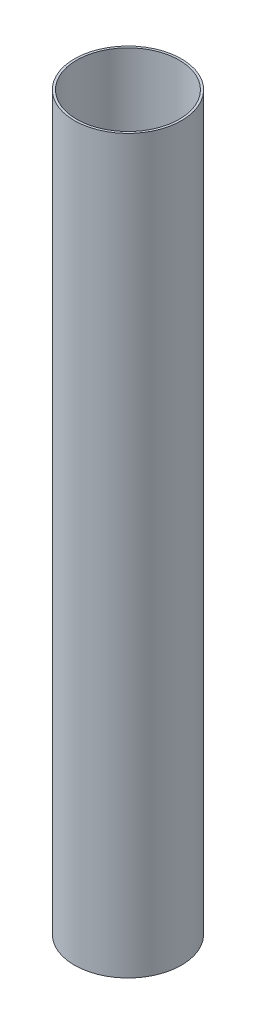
ISO-10303-21;
HEADER;
FILE_DESCRIPTION(('STEP AP214'),'2;1');
FILE_NAME('part.step','',(''),(''),'','','');
FILE_SCHEMA(('AUTOMOTIVE_DESIGN { 1 0 10303 214 1 1 1 1 }'));
ENDSEC;
DATA;
#1=APPLICATION_CONTEXT('core data for automotive mechanical design processes');
#2=APPLICATION_PROTOCOL_DEFINITION('international standard','automotive_design',2000,#1);
#3=PRODUCT_CONTEXT('',#1,'mechanical');
#4=PRODUCT('Part','Part','',(#3));
#5=PRODUCT_RELATED_PRODUCT_CATEGORY('part','',(#4));
#6=PRODUCT_DEFINITION_FORMATION('','',#4);
#7=PRODUCT_DEFINITION_CONTEXT('part definition',#1,'design');
#8=PRODUCT_DEFINITION('design','',#6,#7);
#9=PRODUCT_DEFINITION_SHAPE('','',#8);
#10=(LENGTH_UNIT() NAMED_UNIT(*) SI_UNIT(.MILLI.,.METRE.));
#11=(NAMED_UNIT(*) PLANE_ANGLE_UNIT() SI_UNIT($,.RADIAN.));
#12=(NAMED_UNIT(*) SI_UNIT($,.STERADIAN.) SOLID_ANGLE_UNIT());
#13=UNCERTAINTY_MEASURE_WITH_UNIT(LENGTH_MEASURE(1.E-05),#10,'distance_accuracy_value','');
#14=(GEOMETRIC_REPRESENTATION_CONTEXT(3) GLOBAL_UNCERTAINTY_ASSIGNED_CONTEXT((#13)) GLOBAL_UNIT_ASSIGNED_CONTEXT((#10,
#11,#12)) REPRESENTATION_CONTEXT('',''));
#15=CARTESIAN_POINT('',(0.,0.,0.));
#16=DIRECTION('',(0.,0.,1.));
#17=DIRECTION('',(1.,0.,0.));
#18=AXIS2_PLACEMENT_3D('',#15,#16,#17);
#19=CARTESIAN_POINT('',(0.,1041.4,0.));
#20=DIRECTION('',(0.,1.,0.));
#21=DIRECTION('',(0.,0.,1.));
#22=AXIS2_PLACEMENT_3D('',#19,#20,#21);
#23=PLANE('',#22);
#24=CARTESIAN_POINT('',(0.,1041.4,0.));
#25=DIRECTION('',(0.,1.,0.));
#26=DIRECTION('',(0.,0.,1.));
#27=AXIS2_PLACEMENT_3D('',#24,#25,#26);
#28=CIRCLE('',#27,76.2);
#29=CARTESIAN_POINT('',(0.,1041.4,76.2));
#30=VERTEX_POINT('',#29);
#31=EDGE_CURVE('E10',#30,#30,#28,.T.);
#32=ORIENTED_EDGE('',*,*,#31,.T.);
#33=EDGE_LOOP('',(#32));
#34=FACE_BOUND('',#33,.T.);
#35=CARTESIAN_POINT('',(0.,1041.4,0.));
#36=DIRECTION('',(0.,1.,0.));
#37=DIRECTION('',(0.,0.,1.));
#38=AXIS2_PLACEMENT_3D('',#35,#36,#37);
#39=CIRCLE('',#38,73.025);
#40=CARTESIAN_POINT('',(0.,1041.4,73.025));
#41=VERTEX_POINT('',#40);
#42=EDGE_CURVE('E57',#41,#41,#39,.T.);
#43=ORIENTED_EDGE('',*,*,#42,.F.);
#44=EDGE_LOOP('',(#43));
#45=FACE_BOUND('',#44,.T.);
#46=ADVANCED_FACE('F43',(#34,#45),#23,.T.);
#47=CARTESIAN_POINT('',(0.,0.,0.));
#48=DIRECTION('',(0.,1.,0.));
#49=DIRECTION('',(0.,0.,1.));
#50=AXIS2_PLACEMENT_3D('',#47,#48,#49);
#51=PLANE('',#50);
#52=CARTESIAN_POINT('',(0.,0.,0.));
#53=DIRECTION('',(0.,1.,0.));
#54=DIRECTION('',(0.,0.,1.));
#55=AXIS2_PLACEMENT_3D('',#52,#53,#54);
#56=CIRCLE('',#55,76.2);
#57=CARTESIAN_POINT('',(0.,0.,76.2));
#58=VERTEX_POINT('',#57);
#59=EDGE_CURVE('E50',#58,#58,#56,.T.);
#60=ORIENTED_EDGE('',*,*,#59,.F.);
#61=EDGE_LOOP('',(#60));
#62=FACE_BOUND('',#61,.T.);
#63=CARTESIAN_POINT('',(0.,0.,0.));
#64=DIRECTION('',(0.,1.,0.));
#65=DIRECTION('',(0.,0.,1.));
#66=AXIS2_PLACEMENT_3D('',#63,#64,#65);
#67=CIRCLE('',#66,73.025);
#68=CARTESIAN_POINT('',(0.,0.,73.025));
#69=VERTEX_POINT('',#68);
#70=EDGE_CURVE('E59',#69,#69,#67,.T.);
#71=ORIENTED_EDGE('',*,*,#70,.T.);
#72=EDGE_LOOP('',(#71));
#73=FACE_BOUND('',#72,.T.);
#74=ADVANCED_FACE('F66',(#62,#73),#51,.F.);
#75=CARTESIAN_POINT('',(0.,1041.4,0.));
#76=DIRECTION('',(0.,-1.,0.));
#77=DIRECTION('',(0.,0.,-1.));
#78=AXIS2_PLACEMENT_3D('',#75,#76,#77);
#79=CYLINDRICAL_SURFACE('',#78,76.2);
#80=ORIENTED_EDGE('',*,*,#31,.F.);
#81=EDGE_LOOP('',(#80));
#82=FACE_BOUND('',#81,.T.);
#83=ORIENTED_EDGE('',*,*,#59,.T.);
#84=EDGE_LOOP('',(#83));
#85=FACE_BOUND('',#84,.T.);
#86=ADVANCED_FACE('F44',(#82,#85),#79,.T.);
#87=CARTESIAN_POINT('',(0.,1041.4,0.));
#88=DIRECTION('',(0.,-1.,0.));
#89=DIRECTION('',(0.,0.,-1.));
#90=AXIS2_PLACEMENT_3D('',#87,#88,#89);
#91=CYLINDRICAL_SURFACE('',#90,73.025);
#92=ORIENTED_EDGE('',*,*,#42,.T.);
#93=EDGE_LOOP('',(#92));
#94=FACE_BOUND('',#93,.T.);
#95=ORIENTED_EDGE('',*,*,#70,.F.);
#96=EDGE_LOOP('',(#95));
#97=FACE_BOUND('',#96,.T.);
#98=ADVANCED_FACE('F68',(#94,#97),#91,.F.);
#99=CLOSED_SHELL('',(#46,#74,#86,#98));
#100=MANIFOLD_SOLID_BREP('B2',#99);
#101=ADVANCED_BREP_SHAPE_REPRESENTATION('',(#18,#100),#14);
#102=SHAPE_DEFINITION_REPRESENTATION(#9,#101);
ENDSEC;
END-ISO-10303-21;
